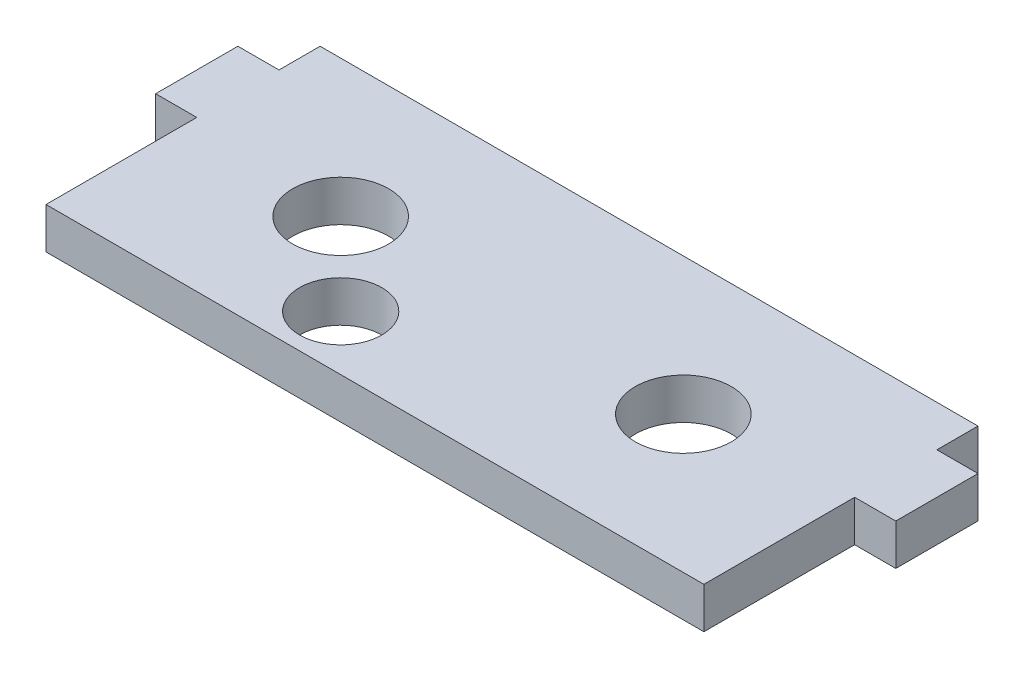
ISO-10303-21;
HEADER;
FILE_DESCRIPTION(('STEP AP214'),'2;1');
FILE_NAME('part.step','',(''),(''),'','','');
FILE_SCHEMA(('AUTOMOTIVE_DESIGN { 1 0 10303 214 1 1 1 1 }'));
ENDSEC;
DATA;
#1=APPLICATION_CONTEXT('core data for automotive mechanical design processes');
#2=APPLICATION_PROTOCOL_DEFINITION('international standard','automotive_design',2000,#1);
#3=PRODUCT_CONTEXT('',#1,'mechanical');
#4=PRODUCT('Part','Part','',(#3));
#5=PRODUCT_RELATED_PRODUCT_CATEGORY('part','',(#4));
#6=PRODUCT_DEFINITION_FORMATION('','',#4);
#7=PRODUCT_DEFINITION_CONTEXT('part definition',#1,'design');
#8=PRODUCT_DEFINITION('design','',#6,#7);
#9=PRODUCT_DEFINITION_SHAPE('','',#8);
#10=(LENGTH_UNIT() NAMED_UNIT(*) SI_UNIT(.MILLI.,.METRE.));
#11=(NAMED_UNIT(*) PLANE_ANGLE_UNIT() SI_UNIT($,.RADIAN.));
#12=(NAMED_UNIT(*) SI_UNIT($,.STERADIAN.) SOLID_ANGLE_UNIT());
#13=UNCERTAINTY_MEASURE_WITH_UNIT(LENGTH_MEASURE(1.E-05),#10,'distance_accuracy_value','');
#14=(GEOMETRIC_REPRESENTATION_CONTEXT(3) GLOBAL_UNCERTAINTY_ASSIGNED_CONTEXT((#13)) GLOBAL_UNIT_ASSIGNED_CONTEXT((#10,
#11,#12)) REPRESENTATION_CONTEXT('',''));
#15=CARTESIAN_POINT('',(0.,0.,0.));
#16=DIRECTION('',(0.,0.,1.));
#17=DIRECTION('',(1.,0.,0.));
#18=AXIS2_PLACEMENT_3D('',#15,#16,#17);
#19=CARTESIAN_POINT('',(24.,3.,10.));
#20=DIRECTION('',(0.,1.,0.));
#21=DIRECTION('',(0.,0.,1.));
#22=AXIS2_PLACEMENT_3D('',#19,#20,#21);
#23=PLANE('',#22);
#24=CARTESIAN_POINT('',(-12.5,3.,0.));
#25=DIRECTION('',(0.,1.,0.));
#26=DIRECTION('',(0.,0.,1.));
#27=AXIS2_PLACEMENT_3D('',#24,#25,#26);
#28=CIRCLE('',#27,3.5);
#29=CARTESIAN_POINT('',(-12.5,3.,3.5));
#30=VERTEX_POINT('',#29);
#31=EDGE_CURVE('E284',#30,#30,#28,.T.);
#32=ORIENTED_EDGE('',*,*,#31,.F.);
#33=EDGE_LOOP('',(#32));
#34=FACE_BOUND('',#33,.T.);
#35=DIRECTION('',(0.,0.,-1.));
#36=VECTOR('',#35,1.);
#37=CARTESIAN_POINT('',(24.,3.,-10.));
#38=LINE('',#37,#36);
#39=CARTESIAN_POINT('',(24.,3.,10.));
#40=VERTEX_POINT('',#39);
#41=CARTESIAN_POINT('',(24.,3.,-1.));
#42=VERTEX_POINT('',#41);
#43=EDGE_CURVE('E197',#40,#42,#38,.T.);
#44=ORIENTED_EDGE('',*,*,#43,.T.);
#45=DIRECTION('',(1.,0.,0.));
#46=VECTOR('',#45,1.);
#47=CARTESIAN_POINT('',(27.,3.,-1.));
#48=LINE('',#47,#46);
#49=CARTESIAN_POINT('',(27.,3.,-1.));
#50=VERTEX_POINT('',#49);
#51=EDGE_CURVE('E133',#42,#50,#48,.T.);
#52=ORIENTED_EDGE('',*,*,#51,.T.);
#53=DIRECTION('',(0.,0.,-1.));
#54=VECTOR('',#53,1.);
#55=CARTESIAN_POINT('',(27.,3.,-7.));
#56=LINE('',#55,#54);
#57=CARTESIAN_POINT('',(27.,3.,-7.));
#58=VERTEX_POINT('',#57);
#59=EDGE_CURVE('E134',#50,#58,#56,.T.);
#60=ORIENTED_EDGE('',*,*,#59,.T.);
#61=DIRECTION('',(-1.,0.,0.));
#62=VECTOR('',#61,1.);
#63=CARTESIAN_POINT('',(27.,3.,-7.));
#64=LINE('',#63,#62);
#65=CARTESIAN_POINT('',(24.,3.,-7.));
#66=VERTEX_POINT('',#65);
#67=EDGE_CURVE('E124',#58,#66,#64,.T.);
#68=ORIENTED_EDGE('',*,*,#67,.T.);
#69=CARTESIAN_POINT('',(24.,3.,-10.));
#70=VERTEX_POINT('',#69);
#71=EDGE_CURVE('E195',#66,#70,#38,.T.);
#72=ORIENTED_EDGE('',*,*,#71,.T.);
#73=DIRECTION('',(-1.,0.,0.));
#74=VECTOR('',#73,1.);
#75=CARTESIAN_POINT('',(-24.,3.,-10.));
#76=LINE('',#75,#74);
#77=CARTESIAN_POINT('',(-24.,3.,-10.));
#78=VERTEX_POINT('',#77);
#79=EDGE_CURVE('E192',#70,#78,#76,.T.);
#80=ORIENTED_EDGE('',*,*,#79,.T.);
#81=DIRECTION('',(0.,0.,1.));
#82=VECTOR('',#81,1.);
#83=CARTESIAN_POINT('',(-24.,3.,-10.));
#84=LINE('',#83,#82);
#85=CARTESIAN_POINT('',(-24.,3.,-7.));
#86=VERTEX_POINT('',#85);
#87=EDGE_CURVE('E231',#78,#86,#84,.T.);
#88=ORIENTED_EDGE('',*,*,#87,.T.);
#89=DIRECTION('',(-1.,0.,0.));
#90=VECTOR('',#89,1.);
#91=CARTESIAN_POINT('',(-27.,3.,-7.));
#92=LINE('',#91,#90);
#93=CARTESIAN_POINT('',(-27.,3.,-7.));
#94=VERTEX_POINT('',#93);
#95=EDGE_CURVE('E160',#86,#94,#92,.T.);
#96=ORIENTED_EDGE('',*,*,#95,.T.);
#97=DIRECTION('',(0.,0.,1.));
#98=VECTOR('',#97,1.);
#99=CARTESIAN_POINT('',(-27.,3.,-7.));
#100=LINE('',#99,#98);
#101=CARTESIAN_POINT('',(-27.,3.,-1.));
#102=VERTEX_POINT('',#101);
#103=EDGE_CURVE('E157',#94,#102,#100,.T.);
#104=ORIENTED_EDGE('',*,*,#103,.T.);
#105=DIRECTION('',(1.,0.,0.));
#106=VECTOR('',#105,1.);
#107=CARTESIAN_POINT('',(-27.,3.,-1.));
#108=LINE('',#107,#106);
#109=CARTESIAN_POINT('',(-24.,3.,-1.));
#110=VERTEX_POINT('',#109);
#111=EDGE_CURVE('E159',#102,#110,#108,.T.);
#112=ORIENTED_EDGE('',*,*,#111,.T.);
#113=CARTESIAN_POINT('',(-24.,3.,10.));
#114=VERTEX_POINT('',#113);
#115=EDGE_CURVE('E170',#110,#114,#84,.T.);
#116=ORIENTED_EDGE('',*,*,#115,.T.);
#117=DIRECTION('',(1.,0.,0.));
#118=VECTOR('',#117,1.);
#119=CARTESIAN_POINT('',(-24.,3.,10.));
#120=LINE('',#119,#118);
#121=EDGE_CURVE('E205',#114,#40,#120,.T.);
#122=ORIENTED_EDGE('',*,*,#121,.T.);
#123=EDGE_LOOP('',(#44,#52,#60,#68,#72,#80,#88,#96,#104,#112,#116,#122));
#124=FACE_BOUND('',#123,.T.);
#125=CARTESIAN_POINT('',(-6.5,3.,6.));
#126=DIRECTION('',(0.,1.,0.));
#127=DIRECTION('',(0.,0.,1.));
#128=AXIS2_PLACEMENT_3D('',#125,#126,#127);
#129=CIRCLE('',#128,3.);
#130=CARTESIAN_POINT('',(-6.5,3.,9.));
#131=VERTEX_POINT('',#130);
#132=EDGE_CURVE('E279',#131,#131,#129,.T.);
#133=ORIENTED_EDGE('',*,*,#132,.F.);
#134=EDGE_LOOP('',(#133));
#135=FACE_BOUND('',#134,.T.);
#136=CARTESIAN_POINT('',(12.5,3.,0.));
#137=DIRECTION('',(0.,1.,0.));
#138=DIRECTION('',(0.,0.,1.));
#139=AXIS2_PLACEMENT_3D('',#136,#137,#138);
#140=CIRCLE('',#139,3.5);
#141=CARTESIAN_POINT('',(12.5,3.,3.5));
#142=VERTEX_POINT('',#141);
#143=EDGE_CURVE('E290',#142,#142,#140,.T.);
#144=ORIENTED_EDGE('',*,*,#143,.F.);
#145=EDGE_LOOP('',(#144));
#146=FACE_BOUND('',#145,.T.);
#147=ADVANCED_FACE('F33',(#34,#124,#135,#146),#23,.T.);
#148=CARTESIAN_POINT('',(24.,0.,10.));
#149=DIRECTION('',(0.,1.,0.));
#150=DIRECTION('',(0.,0.,1.));
#151=AXIS2_PLACEMENT_3D('',#148,#149,#150);
#152=PLANE('',#151);
#153=CARTESIAN_POINT('',(-12.5,0.,0.));
#154=DIRECTION('',(0.,1.,0.));
#155=DIRECTION('',(0.,0.,1.));
#156=AXIS2_PLACEMENT_3D('',#153,#154,#155);
#157=CIRCLE('',#156,3.5);
#158=CARTESIAN_POINT('',(-12.5,0.,3.5));
#159=VERTEX_POINT('',#158);
#160=EDGE_CURVE('E287',#159,#159,#157,.T.);
#161=ORIENTED_EDGE('',*,*,#160,.T.);
#162=EDGE_LOOP('',(#161));
#163=FACE_BOUND('',#162,.T.);
#164=DIRECTION('',(0.,0.,-1.));
#165=VECTOR('',#164,1.);
#166=CARTESIAN_POINT('',(24.,0.,-10.));
#167=LINE('',#166,#165);
#168=CARTESIAN_POINT('',(24.,0.,10.));
#169=VERTEX_POINT('',#168);
#170=CARTESIAN_POINT('',(24.,0.,-1.));
#171=VERTEX_POINT('',#170);
#172=EDGE_CURVE('E201',#169,#171,#167,.T.);
#173=ORIENTED_EDGE('',*,*,#172,.F.);
#174=DIRECTION('',(1.,0.,0.));
#175=VECTOR('',#174,1.);
#176=CARTESIAN_POINT('',(-24.,0.,10.));
#177=LINE('',#176,#175);
#178=CARTESIAN_POINT('',(-24.,0.,10.));
#179=VERTEX_POINT('',#178);
#180=EDGE_CURVE('E212',#179,#169,#177,.T.);
#181=ORIENTED_EDGE('',*,*,#180,.F.);
#182=DIRECTION('',(0.,0.,1.));
#183=VECTOR('',#182,1.);
#184=CARTESIAN_POINT('',(-24.,0.,-10.));
#185=LINE('',#184,#183);
#186=CARTESIAN_POINT('',(-24.,0.,-1.));
#187=VERTEX_POINT('',#186);
#188=EDGE_CURVE('E209',#187,#179,#185,.T.);
#189=ORIENTED_EDGE('',*,*,#188,.F.);
#190=DIRECTION('',(1.,0.,0.));
#191=VECTOR('',#190,1.);
#192=CARTESIAN_POINT('',(-27.,0.,-1.));
#193=LINE('',#192,#191);
#194=CARTESIAN_POINT('',(-27.,0.,-1.));
#195=VERTEX_POINT('',#194);
#196=EDGE_CURVE('E58',#195,#187,#193,.T.);
#197=ORIENTED_EDGE('',*,*,#196,.F.);
#198=DIRECTION('',(0.,0.,1.));
#199=VECTOR('',#198,1.);
#200=CARTESIAN_POINT('',(-27.,0.,-7.));
#201=LINE('',#200,#199);
#202=CARTESIAN_POINT('',(-27.,0.,-7.));
#203=VERTEX_POINT('',#202);
#204=EDGE_CURVE('E149',#203,#195,#201,.T.);
#205=ORIENTED_EDGE('',*,*,#204,.F.);
#206=DIRECTION('',(-1.,0.,0.));
#207=VECTOR('',#206,1.);
#208=CARTESIAN_POINT('',(-27.,0.,-7.));
#209=LINE('',#208,#207);
#210=CARTESIAN_POINT('',(-24.,0.,-7.));
#211=VERTEX_POINT('',#210);
#212=EDGE_CURVE('E147',#211,#203,#209,.T.);
#213=ORIENTED_EDGE('',*,*,#212,.F.);
#214=CARTESIAN_POINT('',(-24.,0.,-10.));
#215=VERTEX_POINT('',#214);
#216=EDGE_CURVE('E217',#215,#211,#185,.T.);
#217=ORIENTED_EDGE('',*,*,#216,.F.);
#218=DIRECTION('',(-1.,0.,0.));
#219=VECTOR('',#218,1.);
#220=CARTESIAN_POINT('',(-24.,0.,-10.));
#221=LINE('',#220,#219);
#222=CARTESIAN_POINT('',(24.,0.,-10.));
#223=VERTEX_POINT('',#222);
#224=EDGE_CURVE('E206',#223,#215,#221,.T.);
#225=ORIENTED_EDGE('',*,*,#224,.F.);
#226=CARTESIAN_POINT('',(24.,0.,-7.));
#227=VERTEX_POINT('',#226);
#228=EDGE_CURVE('E185',#227,#223,#167,.T.);
#229=ORIENTED_EDGE('',*,*,#228,.F.);
#230=DIRECTION('',(-1.,0.,0.));
#231=VECTOR('',#230,1.);
#232=CARTESIAN_POINT('',(27.,0.,-7.));
#233=LINE('',#232,#231);
#234=CARTESIAN_POINT('',(27.,0.,-7.));
#235=VERTEX_POINT('',#234);
#236=EDGE_CURVE('E50',#235,#227,#233,.T.);
#237=ORIENTED_EDGE('',*,*,#236,.F.);
#238=DIRECTION('',(0.,0.,-1.));
#239=VECTOR('',#238,1.);
#240=CARTESIAN_POINT('',(27.,0.,-7.));
#241=LINE('',#240,#239);
#242=CARTESIAN_POINT('',(27.,0.,-1.));
#243=VERTEX_POINT('',#242);
#244=EDGE_CURVE('E146',#243,#235,#241,.T.);
#245=ORIENTED_EDGE('',*,*,#244,.F.);
#246=DIRECTION('',(1.,0.,0.));
#247=VECTOR('',#246,1.);
#248=CARTESIAN_POINT('',(27.,0.,-1.));
#249=LINE('',#248,#247);
#250=EDGE_CURVE('E142',#171,#243,#249,.T.);
#251=ORIENTED_EDGE('',*,*,#250,.F.);
#252=EDGE_LOOP('',(#173,#181,#189,#197,#205,#213,#217,#225,#229,#237,#245,#251));
#253=FACE_BOUND('',#252,.T.);
#254=CARTESIAN_POINT('',(-6.5,0.,6.));
#255=DIRECTION('',(0.,1.,0.));
#256=DIRECTION('',(0.,0.,1.));
#257=AXIS2_PLACEMENT_3D('',#254,#255,#256);
#258=CIRCLE('',#257,3.);
#259=CARTESIAN_POINT('',(-6.5,0.,9.));
#260=VERTEX_POINT('',#259);
#261=EDGE_CURVE('E281',#260,#260,#258,.T.);
#262=ORIENTED_EDGE('',*,*,#261,.T.);
#263=EDGE_LOOP('',(#262));
#264=FACE_BOUND('',#263,.T.);
#265=CARTESIAN_POINT('',(12.5,0.,0.));
#266=DIRECTION('',(0.,1.,0.));
#267=DIRECTION('',(0.,0.,1.));
#268=AXIS2_PLACEMENT_3D('',#265,#266,#267);
#269=CIRCLE('',#268,3.5);
#270=CARTESIAN_POINT('',(12.5,0.,3.5));
#271=VERTEX_POINT('',#270);
#272=EDGE_CURVE('E293',#271,#271,#269,.T.);
#273=ORIENTED_EDGE('',*,*,#272,.T.);
#274=EDGE_LOOP('',(#273));
#275=FACE_BOUND('',#274,.T.);
#276=ADVANCED_FACE('F303',(#163,#253,#264,#275),#152,.F.);
#277=CARTESIAN_POINT('',(24.,3.,-10.));
#278=DIRECTION('',(-1.,0.,0.));
#279=DIRECTION('',(0.,0.,1.));
#280=AXIS2_PLACEMENT_3D('',#277,#278,#279);
#281=PLANE('',#280);
#282=DIRECTION('',(0.,-1.,0.));
#283=VECTOR('',#282,1.);
#284=CARTESIAN_POINT('',(24.,3.,-1.));
#285=LINE('',#284,#283);
#286=EDGE_CURVE('E151',#42,#171,#285,.T.);
#287=ORIENTED_EDGE('',*,*,#286,.F.);
#288=ORIENTED_EDGE('',*,*,#43,.F.);
#289=DIRECTION('',(0.,-1.,0.));
#290=VECTOR('',#289,1.);
#291=CARTESIAN_POINT('',(24.,3.,10.));
#292=LINE('',#291,#290);
#293=EDGE_CURVE('E224',#40,#169,#292,.T.);
#294=ORIENTED_EDGE('',*,*,#293,.T.);
#295=ORIENTED_EDGE('',*,*,#172,.T.);
#296=EDGE_LOOP('',(#287,#288,#294,#295));
#297=FACE_BOUND('',#296,.T.);
#298=ADVANCED_FACE('F267',(#297),#281,.F.);
#299=CARTESIAN_POINT('',(-24.,3.,-10.));
#300=DIRECTION('',(1.,0.,0.));
#301=DIRECTION('',(0.,0.,-1.));
#302=AXIS2_PLACEMENT_3D('',#299,#300,#301);
#303=PLANE('',#302);
#304=DIRECTION('',(0.,-1.,0.));
#305=VECTOR('',#304,1.);
#306=CARTESIAN_POINT('',(-24.,3.,-7.));
#307=LINE('',#306,#305);
#308=EDGE_CURVE('E182',#86,#211,#307,.T.);
#309=ORIENTED_EDGE('',*,*,#308,.F.);
#310=ORIENTED_EDGE('',*,*,#87,.F.);
#311=DIRECTION('',(0.,-1.,0.));
#312=VECTOR('',#311,1.);
#313=CARTESIAN_POINT('',(-24.,3.,-10.));
#314=LINE('',#313,#312);
#315=EDGE_CURVE('E42',#78,#215,#314,.T.);
#316=ORIENTED_EDGE('',*,*,#315,.T.);
#317=ORIENTED_EDGE('',*,*,#216,.T.);
#318=EDGE_LOOP('',(#309,#310,#316,#317));
#319=FACE_BOUND('',#318,.T.);
#320=ADVANCED_FACE('F248',(#319),#303,.F.);
#321=ORIENTED_EDGE('',*,*,#71,.F.);
#322=DIRECTION('',(0.,-1.,0.));
#323=VECTOR('',#322,1.);
#324=CARTESIAN_POINT('',(24.,3.,-7.));
#325=LINE('',#324,#323);
#326=EDGE_CURVE('E130',#66,#227,#325,.T.);
#327=ORIENTED_EDGE('',*,*,#326,.T.);
#328=ORIENTED_EDGE('',*,*,#228,.T.);
#329=DIRECTION('',(0.,-1.,0.));
#330=VECTOR('',#329,1.);
#331=CARTESIAN_POINT('',(24.,3.,-10.));
#332=LINE('',#331,#330);
#333=EDGE_CURVE('E11',#70,#223,#332,.T.);
#334=ORIENTED_EDGE('',*,*,#333,.F.);
#335=EDGE_LOOP('',(#321,#327,#328,#334));
#336=FACE_BOUND('',#335,.T.);
#337=ADVANCED_FACE('F35',(#336),#281,.F.);
#338=CARTESIAN_POINT('',(-24.,3.,-10.));
#339=DIRECTION('',(0.,0.,1.));
#340=DIRECTION('',(1.,0.,0.));
#341=AXIS2_PLACEMENT_3D('',#338,#339,#340);
#342=PLANE('',#341);
#343=ORIENTED_EDGE('',*,*,#224,.T.);
#344=ORIENTED_EDGE('',*,*,#315,.F.);
#345=ORIENTED_EDGE('',*,*,#79,.F.);
#346=ORIENTED_EDGE('',*,*,#333,.T.);
#347=EDGE_LOOP('',(#343,#344,#345,#346));
#348=FACE_BOUND('',#347,.T.);
#349=ADVANCED_FACE('F243',(#348),#342,.F.);
#350=ORIENTED_EDGE('',*,*,#115,.F.);
#351=DIRECTION('',(0.,-1.,0.));
#352=VECTOR('',#351,1.);
#353=CARTESIAN_POINT('',(-24.,3.,-1.));
#354=LINE('',#353,#352);
#355=EDGE_CURVE('E167',#110,#187,#354,.T.);
#356=ORIENTED_EDGE('',*,*,#355,.T.);
#357=ORIENTED_EDGE('',*,*,#188,.T.);
#358=DIRECTION('',(0.,-1.,0.));
#359=VECTOR('',#358,1.);
#360=CARTESIAN_POINT('',(-24.,3.,10.));
#361=LINE('',#360,#359);
#362=EDGE_CURVE('E222',#114,#179,#361,.T.);
#363=ORIENTED_EDGE('',*,*,#362,.F.);
#364=EDGE_LOOP('',(#350,#356,#357,#363));
#365=FACE_BOUND('',#364,.T.);
#366=ADVANCED_FACE('F262',(#365),#303,.F.);
#367=CARTESIAN_POINT('',(-24.,3.,10.));
#368=DIRECTION('',(0.,0.,-1.));
#369=DIRECTION('',(-1.,0.,0.));
#370=AXIS2_PLACEMENT_3D('',#367,#368,#369);
#371=PLANE('',#370);
#372=ORIENTED_EDGE('',*,*,#180,.T.);
#373=ORIENTED_EDGE('',*,*,#293,.F.);
#374=ORIENTED_EDGE('',*,*,#121,.F.);
#375=ORIENTED_EDGE('',*,*,#362,.T.);
#376=EDGE_LOOP('',(#372,#373,#374,#375));
#377=FACE_BOUND('',#376,.T.);
#378=ADVANCED_FACE('F265',(#377),#371,.F.);
#379=CARTESIAN_POINT('',(-27.,3.,-7.));
#380=DIRECTION('',(0.,0.,1.));
#381=DIRECTION('',(1.,0.,0.));
#382=AXIS2_PLACEMENT_3D('',#379,#380,#381);
#383=PLANE('',#382);
#384=ORIENTED_EDGE('',*,*,#212,.T.);
#385=DIRECTION('',(0.,-1.,0.));
#386=VECTOR('',#385,1.);
#387=CARTESIAN_POINT('',(-27.,3.,-7.));
#388=LINE('',#387,#386);
#389=EDGE_CURVE('E186',#94,#203,#388,.T.);
#390=ORIENTED_EDGE('',*,*,#389,.F.);
#391=ORIENTED_EDGE('',*,*,#95,.F.);
#392=ORIENTED_EDGE('',*,*,#308,.T.);
#393=EDGE_LOOP('',(#384,#390,#391,#392));
#394=FACE_BOUND('',#393,.T.);
#395=ADVANCED_FACE('F250',(#394),#383,.F.);
#396=CARTESIAN_POINT('',(-27.,3.,-7.));
#397=DIRECTION('',(1.,0.,0.));
#398=DIRECTION('',(0.,0.,-1.));
#399=AXIS2_PLACEMENT_3D('',#396,#397,#398);
#400=PLANE('',#399);
#401=ORIENTED_EDGE('',*,*,#204,.T.);
#402=DIRECTION('',(0.,-1.,0.));
#403=VECTOR('',#402,1.);
#404=CARTESIAN_POINT('',(-27.,3.,-1.));
#405=LINE('',#404,#403);
#406=EDGE_CURVE('E164',#102,#195,#405,.T.);
#407=ORIENTED_EDGE('',*,*,#406,.F.);
#408=ORIENTED_EDGE('',*,*,#103,.F.);
#409=ORIENTED_EDGE('',*,*,#389,.T.);
#410=EDGE_LOOP('',(#401,#407,#408,#409));
#411=FACE_BOUND('',#410,.T.);
#412=ADVANCED_FACE('F257',(#411),#400,.F.);
#413=CARTESIAN_POINT('',(-27.,3.,-1.));
#414=DIRECTION('',(0.,0.,-1.));
#415=DIRECTION('',(-1.,0.,0.));
#416=AXIS2_PLACEMENT_3D('',#413,#414,#415);
#417=PLANE('',#416);
#418=ORIENTED_EDGE('',*,*,#196,.T.);
#419=ORIENTED_EDGE('',*,*,#355,.F.);
#420=ORIENTED_EDGE('',*,*,#111,.F.);
#421=ORIENTED_EDGE('',*,*,#406,.T.);
#422=EDGE_LOOP('',(#418,#419,#420,#421));
#423=FACE_BOUND('',#422,.T.);
#424=ADVANCED_FACE('F259',(#423),#417,.F.);
#425=CARTESIAN_POINT('',(27.,3.,-7.));
#426=DIRECTION('',(-1.,0.,0.));
#427=DIRECTION('',(0.,0.,1.));
#428=AXIS2_PLACEMENT_3D('',#425,#426,#427);
#429=PLANE('',#428);
#430=ORIENTED_EDGE('',*,*,#244,.T.);
#431=DIRECTION('',(0.,-1.,0.));
#432=VECTOR('',#431,1.);
#433=CARTESIAN_POINT('',(27.,3.,-7.));
#434=LINE('',#433,#432);
#435=EDGE_CURVE('E128',#58,#235,#434,.T.);
#436=ORIENTED_EDGE('',*,*,#435,.F.);
#437=ORIENTED_EDGE('',*,*,#59,.F.);
#438=DIRECTION('',(0.,-1.,0.));
#439=VECTOR('',#438,1.);
#440=CARTESIAN_POINT('',(27.,3.,-1.));
#441=LINE('',#440,#439);
#442=EDGE_CURVE('E270',#50,#243,#441,.T.);
#443=ORIENTED_EDGE('',*,*,#442,.T.);
#444=EDGE_LOOP('',(#430,#436,#437,#443));
#445=FACE_BOUND('',#444,.T.);
#446=ADVANCED_FACE('F144',(#445),#429,.F.);
#447=CARTESIAN_POINT('',(27.,3.,-7.));
#448=DIRECTION('',(0.,0.,1.));
#449=DIRECTION('',(1.,0.,0.));
#450=AXIS2_PLACEMENT_3D('',#447,#448,#449);
#451=PLANE('',#450);
#452=ORIENTED_EDGE('',*,*,#236,.T.);
#453=ORIENTED_EDGE('',*,*,#326,.F.);
#454=ORIENTED_EDGE('',*,*,#67,.F.);
#455=ORIENTED_EDGE('',*,*,#435,.T.);
#456=EDGE_LOOP('',(#452,#453,#454,#455));
#457=FACE_BOUND('',#456,.T.);
#458=ADVANCED_FACE('F126',(#457),#451,.F.);
#459=CARTESIAN_POINT('',(27.,3.,-1.));
#460=DIRECTION('',(0.,0.,-1.));
#461=DIRECTION('',(-1.,0.,0.));
#462=AXIS2_PLACEMENT_3D('',#459,#460,#461);
#463=PLANE('',#462);
#464=ORIENTED_EDGE('',*,*,#250,.T.);
#465=ORIENTED_EDGE('',*,*,#442,.F.);
#466=ORIENTED_EDGE('',*,*,#51,.F.);
#467=ORIENTED_EDGE('',*,*,#286,.T.);
#468=EDGE_LOOP('',(#464,#465,#466,#467));
#469=FACE_BOUND('',#468,.T.);
#470=ADVANCED_FACE('F387',(#469),#463,.F.);
#471=CARTESIAN_POINT('',(-6.5,3.,6.));
#472=DIRECTION('',(0.,-1.,0.));
#473=DIRECTION('',(0.,0.,-1.));
#474=AXIS2_PLACEMENT_3D('',#471,#472,#473);
#475=CYLINDRICAL_SURFACE('',#474,3.);
#476=ORIENTED_EDGE('',*,*,#132,.T.);
#477=EDGE_LOOP('',(#476));
#478=FACE_BOUND('',#477,.T.);
#479=ORIENTED_EDGE('',*,*,#261,.F.);
#480=EDGE_LOOP('',(#479));
#481=FACE_BOUND('',#480,.T.);
#482=ADVANCED_FACE('F395',(#478,#481),#475,.F.);
#483=CARTESIAN_POINT('',(-12.5,3.,0.));
#484=DIRECTION('',(0.,-1.,0.));
#485=DIRECTION('',(0.,0.,-1.));
#486=AXIS2_PLACEMENT_3D('',#483,#484,#485);
#487=CYLINDRICAL_SURFACE('',#486,3.5);
#488=ORIENTED_EDGE('',*,*,#31,.T.);
#489=EDGE_LOOP('',(#488));
#490=FACE_BOUND('',#489,.T.);
#491=ORIENTED_EDGE('',*,*,#160,.F.);
#492=EDGE_LOOP('',(#491));
#493=FACE_BOUND('',#492,.T.);
#494=ADVANCED_FACE('F417',(#490,#493),#487,.F.);
#495=CARTESIAN_POINT('',(12.5,3.,0.));
#496=DIRECTION('',(0.,-1.,0.));
#497=DIRECTION('',(0.,0.,-1.));
#498=AXIS2_PLACEMENT_3D('',#495,#496,#497);
#499=CYLINDRICAL_SURFACE('',#498,3.5);
#500=ORIENTED_EDGE('',*,*,#143,.T.);
#501=EDGE_LOOP('',(#500));
#502=FACE_BOUND('',#501,.T.);
#503=ORIENTED_EDGE('',*,*,#272,.F.);
#504=EDGE_LOOP('',(#503));
#505=FACE_BOUND('',#504,.T.);
#506=ADVANCED_FACE('F299',(#502,#505),#499,.F.);
#507=CLOSED_SHELL('',(#147,#276,#298,#320,#337,#349,#366,#378,#395,#412,#424,#446,#458,#470,
#482,#494,#506));
#508=MANIFOLD_SOLID_BREP('B2',#507);
#509=ADVANCED_BREP_SHAPE_REPRESENTATION('',(#18,#508),#14);
#510=SHAPE_DEFINITION_REPRESENTATION(#9,#509);
ENDSEC;
END-ISO-10303-21;
